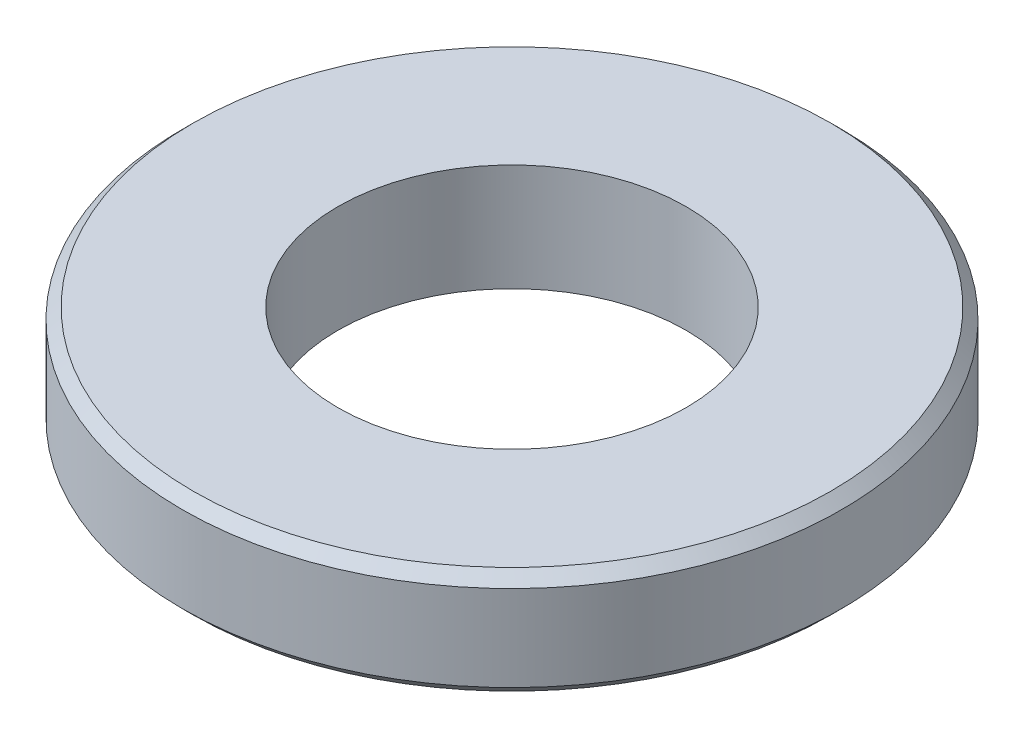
from build123d import *

# Parameters (mm, degrees)
SKETCH1_R           = 12.3
SKETCH1_R_2         = 6.5
BOSS_EXTRUDE1_DEPTH = 4
CHAMFER1_SIZE       = 0.4


with BuildPart() as part:
    # Sketch1 → Boss-Extrude1 (new body)
    with BuildSketch(Plane(origin=(0, 0, 0), x_dir=(1, 0, 0), z_dir=(0, 1, 0))):
        with Locations(Location((0, 0, 0), (0, 0, 270))):
            Circle(SKETCH1_R)
        with Locations(Location((0, 0, 0), (0, 0, 270))):
            Circle(SKETCH1_R_2, mode=Mode.SUBTRACT)
    extrude(amount=BOSS_EXTRUDE1_DEPTH)

    # Chamfer1
    chamfer1_edges = [part.edges().sort_by_distance(p)[0] for p in [
        (0, 0, -12.3),
        (0, 4, -12.3),
    ]]
    chamfer(chamfer1_edges, length=CHAMFER1_SIZE)


solid = part.part
